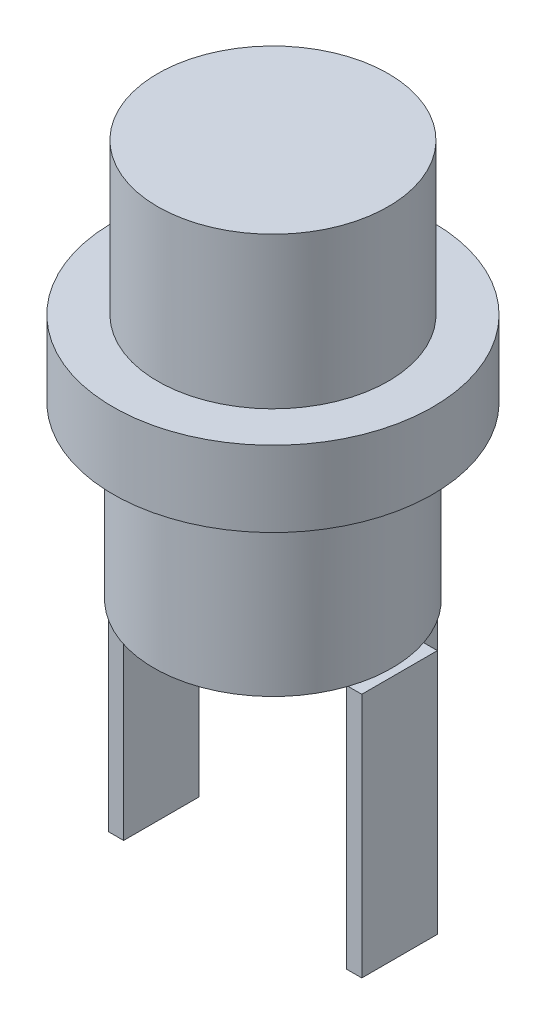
ISO-10303-21;
HEADER;
FILE_DESCRIPTION(('STEP AP214'),'2;1');
FILE_NAME('part.step','',(''),(''),'','','');
FILE_SCHEMA(('AUTOMOTIVE_DESIGN { 1 0 10303 214 1 1 1 1 }'));
ENDSEC;
DATA;
#1=APPLICATION_CONTEXT('core data for automotive mechanical design processes');
#2=APPLICATION_PROTOCOL_DEFINITION('international standard','automotive_design',2000,#1);
#3=PRODUCT_CONTEXT('',#1,'mechanical');
#4=PRODUCT('Part','Part','',(#3));
#5=PRODUCT_RELATED_PRODUCT_CATEGORY('part','',(#4));
#6=PRODUCT_DEFINITION_FORMATION('','',#4);
#7=PRODUCT_DEFINITION_CONTEXT('part definition',#1,'design');
#8=PRODUCT_DEFINITION('design','',#6,#7);
#9=PRODUCT_DEFINITION_SHAPE('','',#8);
#10=(LENGTH_UNIT() NAMED_UNIT(*) SI_UNIT(.MILLI.,.METRE.));
#11=(NAMED_UNIT(*) PLANE_ANGLE_UNIT() SI_UNIT($,.RADIAN.));
#12=(NAMED_UNIT(*) SI_UNIT($,.STERADIAN.) SOLID_ANGLE_UNIT());
#13=UNCERTAINTY_MEASURE_WITH_UNIT(LENGTH_MEASURE(1.E-05),#10,'distance_accuracy_value','');
#14=(GEOMETRIC_REPRESENTATION_CONTEXT(3) GLOBAL_UNCERTAINTY_ASSIGNED_CONTEXT((#13)) GLOBAL_UNIT_ASSIGNED_CONTEXT((#10,
#11,#12)) REPRESENTATION_CONTEXT('',''));
#15=CARTESIAN_POINT('',(0.,0.,0.));
#16=DIRECTION('',(0.,0.,1.));
#17=DIRECTION('',(1.,0.,0.));
#18=AXIS2_PLACEMENT_3D('',#15,#16,#17);
#19=CARTESIAN_POINT('',(0.,-8.2804,0.));
#20=DIRECTION('',(0.,-1.,0.));
#21=DIRECTION('',(0.,0.,-1.));
#22=AXIS2_PLACEMENT_3D('',#19,#20,#21);
#23=PLANE('',#22);
#24=CARTESIAN_POINT('',(0.,-8.2804,0.));
#25=DIRECTION('',(0.,-1.,0.));
#26=DIRECTION('',(0.,0.,-1.));
#27=AXIS2_PLACEMENT_3D('',#24,#25,#26);
#28=CIRCLE('',#27,4.0005);
#29=CARTESIAN_POINT('',(1.27,-8.2804,-3.79356036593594));
#30=VERTEX_POINT('',#29);
#31=CARTESIAN_POINT('',(3.79356036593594,-8.2804,-1.27));
#32=VERTEX_POINT('',#31);
#33=EDGE_CURVE('E284',#30,#32,#28,.T.);
#34=ORIENTED_EDGE('',*,*,#33,.T.);
#35=DIRECTION('',(1.,0.,0.));
#36=VECTOR('',#35,1.);
#37=CARTESIAN_POINT('',(3.7465,-8.2804,-1.27));
#38=LINE('',#37,#36);
#39=CARTESIAN_POINT('',(3.7465,-8.2804,-1.27));
#40=VERTEX_POINT('',#39);
#41=EDGE_CURVE('E50',#40,#32,#38,.T.);
#42=ORIENTED_EDGE('',*,*,#41,.F.);
#43=DIRECTION('',(0.,0.,-1.));
#44=VECTOR('',#43,1.);
#45=CARTESIAN_POINT('',(3.7465,-8.2804,-1.27));
#46=LINE('',#45,#44);
#47=CARTESIAN_POINT('',(3.7465,-8.2804,1.27));
#48=VERTEX_POINT('',#47);
#49=EDGE_CURVE('E55',#48,#40,#46,.T.);
#50=ORIENTED_EDGE('',*,*,#49,.F.);
#51=DIRECTION('',(-1.,0.,0.));
#52=VECTOR('',#51,1.);
#53=CARTESIAN_POINT('',(3.7465,-8.2804,1.27));
#54=LINE('',#53,#52);
#55=CARTESIAN_POINT('',(3.79356036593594,-8.2804,1.27));
#56=VERTEX_POINT('',#55);
#57=EDGE_CURVE('E293',#56,#48,#54,.T.);
#58=ORIENTED_EDGE('',*,*,#57,.F.);
#59=CARTESIAN_POINT('',(-3.79356036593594,-8.2804,1.27));
#60=VERTEX_POINT('',#59);
#61=EDGE_CURVE('E240',#56,#60,#28,.T.);
#62=ORIENTED_EDGE('',*,*,#61,.T.);
#63=DIRECTION('',(-1.,0.,0.));
#64=VECTOR('',#63,1.);
#65=CARTESIAN_POINT('',(-3.7465,-8.2804,1.27));
#66=LINE('',#65,#64);
#67=CARTESIAN_POINT('',(-3.7465,-8.2804,1.27));
#68=VERTEX_POINT('',#67);
#69=EDGE_CURVE('E205',#68,#60,#66,.T.);
#70=ORIENTED_EDGE('',*,*,#69,.F.);
#71=DIRECTION('',(0.,0.,1.));
#72=VECTOR('',#71,1.);
#73=CARTESIAN_POINT('',(-3.7465,-8.2804,-1.27));
#74=LINE('',#73,#72);
#75=CARTESIAN_POINT('',(-3.7465,-8.2804,-1.27));
#76=VERTEX_POINT('',#75);
#77=EDGE_CURVE('E217',#76,#68,#74,.T.);
#78=ORIENTED_EDGE('',*,*,#77,.F.);
#79=DIRECTION('',(1.,0.,0.));
#80=VECTOR('',#79,1.);
#81=CARTESIAN_POINT('',(-3.7465,-8.2804,-1.27));
#82=LINE('',#81,#80);
#83=CARTESIAN_POINT('',(-3.79356036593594,-8.2804,-1.27));
#84=VERTEX_POINT('',#83);
#85=EDGE_CURVE('E43',#84,#76,#82,.T.);
#86=ORIENTED_EDGE('',*,*,#85,.F.);
#87=CARTESIAN_POINT('',(-1.27,-8.2804,-3.79356036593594));
#88=VERTEX_POINT('',#87);
#89=EDGE_CURVE('E239',#84,#88,#28,.T.);
#90=ORIENTED_EDGE('',*,*,#89,.T.);
#91=DIRECTION('',(0.,0.,-1.));
#92=VECTOR('',#91,1.);
#93=CARTESIAN_POINT('',(-1.27,-8.2804,-4.2545));
#94=LINE('',#93,#92);
#95=CARTESIAN_POINT('',(-1.27,-8.2804,-3.7465));
#96=VERTEX_POINT('',#95);
#97=EDGE_CURVE('E166',#96,#88,#94,.T.);
#98=ORIENTED_EDGE('',*,*,#97,.F.);
#99=DIRECTION('',(-1.,0.,0.));
#100=VECTOR('',#99,1.);
#101=CARTESIAN_POINT('',(1.27,-8.2804,-3.7465));
#102=LINE('',#101,#100);
#103=CARTESIAN_POINT('',(1.27,-8.2804,-3.7465));
#104=VERTEX_POINT('',#103);
#105=EDGE_CURVE('E176',#104,#96,#102,.T.);
#106=ORIENTED_EDGE('',*,*,#105,.F.);
#107=DIRECTION('',(0.,0.,-1.));
#108=VECTOR('',#107,1.);
#109=CARTESIAN_POINT('',(1.27,-8.2804,0.));
#110=LINE('',#109,#108);
#111=EDGE_CURVE('E11',#104,#30,#110,.T.);
#112=ORIENTED_EDGE('',*,*,#111,.T.);
#113=EDGE_LOOP('',(#34,#42,#50,#58,#62,#70,#78,#86,#90,#98,#106,#112));
#114=FACE_BOUND('',#113,.T.);
#115=ADVANCED_FACE('F35',(#114),#23,.T.);
#116=CARTESIAN_POINT('',(0.,-2.54,0.));
#117=DIRECTION('',(0.,-1.,0.));
#118=DIRECTION('',(0.,0.,-1.));
#119=AXIS2_PLACEMENT_3D('',#116,#117,#118);
#120=PLANE('',#119);
#121=CARTESIAN_POINT('',(0.,-2.54,0.));
#122=DIRECTION('',(0.,-1.,0.));
#123=DIRECTION('',(0.,0.,-1.));
#124=AXIS2_PLACEMENT_3D('',#121,#122,#123);
#125=CIRCLE('',#124,5.3721);
#126=CARTESIAN_POINT('',(0.,-2.54,-5.3721));
#127=VERTEX_POINT('',#126);
#128=EDGE_CURVE('E243',#127,#127,#125,.T.);
#129=ORIENTED_EDGE('',*,*,#128,.T.);
#130=EDGE_LOOP('',(#129));
#131=FACE_BOUND('',#130,.T.);
#132=CARTESIAN_POINT('',(0.,-2.54,0.));
#133=DIRECTION('',(0.,-1.,0.));
#134=DIRECTION('',(0.,0.,-1.));
#135=AXIS2_PLACEMENT_3D('',#132,#133,#134);
#136=CIRCLE('',#135,4.0005);
#137=CARTESIAN_POINT('',(0.,-2.54,-4.0005));
#138=VERTEX_POINT('',#137);
#139=EDGE_CURVE('E234',#138,#138,#136,.T.);
#140=ORIENTED_EDGE('',*,*,#139,.F.);
#141=EDGE_LOOP('',(#140));
#142=FACE_BOUND('',#141,.T.);
#143=ADVANCED_FACE('F321',(#131,#142),#120,.T.);
#144=CARTESIAN_POINT('',(0.,5.08,0.));
#145=DIRECTION('',(0.,-1.,0.));
#146=DIRECTION('',(0.,0.,-1.));
#147=AXIS2_PLACEMENT_3D('',#144,#145,#146);
#148=CYLINDRICAL_SURFACE('',#147,3.8735);
#149=CARTESIAN_POINT('',(0.,5.08,0.));
#150=DIRECTION('',(0.,1.,0.));
#151=DIRECTION('',(0.,0.,1.));
#152=AXIS2_PLACEMENT_3D('',#149,#150,#151);
#153=CIRCLE('',#152,3.8735);
#154=CARTESIAN_POINT('',(0.,5.08,3.8735));
#155=VERTEX_POINT('',#154);
#156=EDGE_CURVE('E250',#155,#155,#153,.T.);
#157=ORIENTED_EDGE('',*,*,#156,.F.);
#158=EDGE_LOOP('',(#157));
#159=FACE_BOUND('',#158,.T.);
#160=CARTESIAN_POINT('',(0.,0.,0.));
#161=DIRECTION('',(0.,-1.,0.));
#162=DIRECTION('',(0.,0.,-1.));
#163=AXIS2_PLACEMENT_3D('',#160,#161,#162);
#164=CIRCLE('',#163,3.8735);
#165=CARTESIAN_POINT('',(0.,0.,-3.8735));
#166=VERTEX_POINT('',#165);
#167=EDGE_CURVE('E246',#166,#166,#164,.T.);
#168=ORIENTED_EDGE('',*,*,#167,.F.);
#169=EDGE_LOOP('',(#168));
#170=FACE_BOUND('',#169,.T.);
#171=ADVANCED_FACE('F37',(#159,#170),#148,.T.);
#172=CARTESIAN_POINT('',(0.,5.08,0.));
#173=DIRECTION('',(0.,1.,0.));
#174=DIRECTION('',(0.,0.,1.));
#175=AXIS2_PLACEMENT_3D('',#172,#173,#174);
#176=PLANE('',#175);
#177=ORIENTED_EDGE('',*,*,#156,.T.);
#178=EDGE_LOOP('',(#177));
#179=FACE_BOUND('',#178,.T.);
#180=ADVANCED_FACE('F337',(#179),#176,.T.);
#181=CARTESIAN_POINT('',(0.,0.,0.));
#182=DIRECTION('',(0.,-1.,0.));
#183=DIRECTION('',(0.,0.,-1.));
#184=AXIS2_PLACEMENT_3D('',#181,#182,#183);
#185=PLANE('',#184);
#186=CARTESIAN_POINT('',(0.,0.,0.));
#187=DIRECTION('',(0.,-1.,0.));
#188=DIRECTION('',(0.,0.,-1.));
#189=AXIS2_PLACEMENT_3D('',#186,#187,#188);
#190=CIRCLE('',#189,5.3721);
#191=CARTESIAN_POINT('',(0.,0.,-5.3721));
#192=VERTEX_POINT('',#191);
#193=EDGE_CURVE('E238',#192,#192,#190,.T.);
#194=ORIENTED_EDGE('',*,*,#193,.F.);
#195=EDGE_LOOP('',(#194));
#196=FACE_BOUND('',#195,.T.);
#197=ORIENTED_EDGE('',*,*,#167,.T.);
#198=EDGE_LOOP('',(#197));
#199=FACE_BOUND('',#198,.T.);
#200=ADVANCED_FACE('F334',(#196,#199),#185,.F.);
#201=CARTESIAN_POINT('',(0.,-2.54,0.));
#202=DIRECTION('',(0.,1.,0.));
#203=DIRECTION('',(0.,0.,1.));
#204=AXIS2_PLACEMENT_3D('',#201,#202,#203);
#205=CYLINDRICAL_SURFACE('',#204,5.3721);
#206=ORIENTED_EDGE('',*,*,#128,.F.);
#207=EDGE_LOOP('',(#206));
#208=FACE_BOUND('',#207,.T.);
#209=ORIENTED_EDGE('',*,*,#193,.T.);
#210=EDGE_LOOP('',(#209));
#211=FACE_BOUND('',#210,.T.);
#212=ADVANCED_FACE('F332',(#208,#211),#205,.T.);
#213=CARTESIAN_POINT('',(0.,-8.2804,0.));
#214=DIRECTION('',(0.,1.,0.));
#215=DIRECTION('',(0.,0.,1.));
#216=AXIS2_PLACEMENT_3D('',#213,#214,#215);
#217=CYLINDRICAL_SURFACE('',#216,4.0005);
#218=EDGE_CURVE('E235',#60,#84,#28,.T.);
#219=ORIENTED_EDGE('',*,*,#218,.F.);
#220=ORIENTED_EDGE('',*,*,#61,.F.);
#221=EDGE_CURVE('E287',#32,#56,#28,.T.);
#222=ORIENTED_EDGE('',*,*,#221,.F.);
#223=ORIENTED_EDGE('',*,*,#33,.F.);
#224=EDGE_CURVE('E282',#88,#30,#28,.T.);
#225=ORIENTED_EDGE('',*,*,#224,.F.);
#226=ORIENTED_EDGE('',*,*,#89,.F.);
#227=EDGE_LOOP('',(#219,#220,#222,#223,#225,#226));
#228=FACE_BOUND('',#227,.T.);
#229=ORIENTED_EDGE('',*,*,#139,.T.);
#230=EDGE_LOOP('',(#229));
#231=FACE_BOUND('',#230,.T.);
#232=ADVANCED_FACE('F278',(#228,#231),#217,.T.);
#233=CARTESIAN_POINT('',(0.,-8.2804,0.));
#234=DIRECTION('',(0.,-1.,0.));
#235=DIRECTION('',(0.,0.,-1.));
#236=AXIS2_PLACEMENT_3D('',#233,#234,#235);
#237=PLANE('',#236);
#238=CARTESIAN_POINT('',(-4.2545,-8.2804,1.27));
#239=VERTEX_POINT('',#238);
#240=EDGE_CURVE('E220',#60,#239,#66,.T.);
#241=ORIENTED_EDGE('',*,*,#240,.F.);
#242=ORIENTED_EDGE('',*,*,#218,.T.);
#243=CARTESIAN_POINT('',(-4.2545,-8.2804,-1.27));
#244=VERTEX_POINT('',#243);
#245=EDGE_CURVE('E214',#244,#84,#82,.T.);
#246=ORIENTED_EDGE('',*,*,#245,.F.);
#247=DIRECTION('',(0.,0.,-1.));
#248=VECTOR('',#247,1.);
#249=CARTESIAN_POINT('',(-4.2545,-8.2804,-1.27));
#250=LINE('',#249,#248);
#251=EDGE_CURVE('E200',#239,#244,#250,.T.);
#252=ORIENTED_EDGE('',*,*,#251,.F.);
#253=EDGE_LOOP('',(#241,#242,#246,#252));
#254=FACE_BOUND('',#253,.T.);
#255=ADVANCED_FACE('F275',(#254),#237,.F.);
#256=CARTESIAN_POINT('',(-4.2545,-16.5354,-1.27));
#257=DIRECTION('',(1.,0.,0.));
#258=DIRECTION('',(0.,0.,-1.));
#259=AXIS2_PLACEMENT_3D('',#256,#257,#258);
#260=PLANE('',#259);
#261=ORIENTED_EDGE('',*,*,#251,.T.);
#262=DIRECTION('',(0.,1.,0.));
#263=VECTOR('',#262,1.);
#264=CARTESIAN_POINT('',(-4.2545,-16.5354,-1.27));
#265=LINE('',#264,#263);
#266=CARTESIAN_POINT('',(-4.2545,-16.5354,-1.27));
#267=VERTEX_POINT('',#266);
#268=EDGE_CURVE('E231',#267,#244,#265,.T.);
#269=ORIENTED_EDGE('',*,*,#268,.F.);
#270=DIRECTION('',(0.,0.,-1.));
#271=VECTOR('',#270,1.);
#272=CARTESIAN_POINT('',(-4.2545,-16.5354,-1.27));
#273=LINE('',#272,#271);
#274=CARTESIAN_POINT('',(-4.2545,-16.5354,1.27));
#275=VERTEX_POINT('',#274);
#276=EDGE_CURVE('E201',#275,#267,#273,.T.);
#277=ORIENTED_EDGE('',*,*,#276,.F.);
#278=DIRECTION('',(0.,1.,0.));
#279=VECTOR('',#278,1.);
#280=CARTESIAN_POINT('',(-4.2545,-16.5354,1.27));
#281=LINE('',#280,#279);
#282=EDGE_CURVE('E211',#275,#239,#281,.T.);
#283=ORIENTED_EDGE('',*,*,#282,.T.);
#284=EDGE_LOOP('',(#261,#269,#277,#283));
#285=FACE_BOUND('',#284,.T.);
#286=ADVANCED_FACE('F272',(#285),#260,.F.);
#287=CARTESIAN_POINT('',(-3.7465,-16.5354,-1.27));
#288=DIRECTION('',(0.,0.,1.));
#289=DIRECTION('',(1.,0.,0.));
#290=AXIS2_PLACEMENT_3D('',#287,#288,#289);
#291=PLANE('',#290);
#292=ORIENTED_EDGE('',*,*,#245,.T.);
#293=ORIENTED_EDGE('',*,*,#85,.T.);
#294=DIRECTION('',(0.,1.,0.));
#295=VECTOR('',#294,1.);
#296=CARTESIAN_POINT('',(-3.7465,-16.5354,-1.27));
#297=LINE('',#296,#295);
#298=CARTESIAN_POINT('',(-3.7465,-16.5354,-1.27));
#299=VERTEX_POINT('',#298);
#300=EDGE_CURVE('E228',#299,#76,#297,.T.);
#301=ORIENTED_EDGE('',*,*,#300,.F.);
#302=DIRECTION('',(1.,0.,0.));
#303=VECTOR('',#302,1.);
#304=CARTESIAN_POINT('',(-3.7465,-16.5354,-1.27));
#305=LINE('',#304,#303);
#306=EDGE_CURVE('E204',#267,#299,#305,.T.);
#307=ORIENTED_EDGE('',*,*,#306,.F.);
#308=ORIENTED_EDGE('',*,*,#268,.T.);
#309=EDGE_LOOP('',(#292,#293,#301,#307,#308));
#310=FACE_BOUND('',#309,.T.);
#311=ADVANCED_FACE('F257',(#310),#291,.F.);
#312=CARTESIAN_POINT('',(-3.7465,-16.5354,-1.27));
#313=DIRECTION('',(-1.,0.,0.));
#314=DIRECTION('',(0.,0.,1.));
#315=AXIS2_PLACEMENT_3D('',#312,#313,#314);
#316=PLANE('',#315);
#317=ORIENTED_EDGE('',*,*,#77,.T.);
#318=DIRECTION('',(0.,1.,0.));
#319=VECTOR('',#318,1.);
#320=CARTESIAN_POINT('',(-3.7465,-16.5354,1.27));
#321=LINE('',#320,#319);
#322=CARTESIAN_POINT('',(-3.7465,-16.5354,1.27));
#323=VERTEX_POINT('',#322);
#324=EDGE_CURVE('E225',#323,#68,#321,.T.);
#325=ORIENTED_EDGE('',*,*,#324,.F.);
#326=DIRECTION('',(0.,0.,1.));
#327=VECTOR('',#326,1.);
#328=CARTESIAN_POINT('',(-3.7465,-16.5354,-1.27));
#329=LINE('',#328,#327);
#330=EDGE_CURVE('E207',#299,#323,#329,.T.);
#331=ORIENTED_EDGE('',*,*,#330,.F.);
#332=ORIENTED_EDGE('',*,*,#300,.T.);
#333=EDGE_LOOP('',(#317,#325,#331,#332));
#334=FACE_BOUND('',#333,.T.);
#335=ADVANCED_FACE('F262',(#334),#316,.F.);
#336=CARTESIAN_POINT('',(-3.7465,-16.5354,1.27));
#337=DIRECTION('',(0.,0.,-1.));
#338=DIRECTION('',(-1.,0.,0.));
#339=AXIS2_PLACEMENT_3D('',#336,#337,#338);
#340=PLANE('',#339);
#341=ORIENTED_EDGE('',*,*,#69,.T.);
#342=ORIENTED_EDGE('',*,*,#240,.T.);
#343=ORIENTED_EDGE('',*,*,#282,.F.);
#344=DIRECTION('',(-1.,0.,0.));
#345=VECTOR('',#344,1.);
#346=CARTESIAN_POINT('',(-3.7465,-16.5354,1.27));
#347=LINE('',#346,#345);
#348=EDGE_CURVE('E209',#323,#275,#347,.T.);
#349=ORIENTED_EDGE('',*,*,#348,.F.);
#350=ORIENTED_EDGE('',*,*,#324,.T.);
#351=EDGE_LOOP('',(#341,#342,#343,#349,#350));
#352=FACE_BOUND('',#351,.T.);
#353=ADVANCED_FACE('F400',(#352),#340,.F.);
#354=CARTESIAN_POINT('',(0.,-16.5354,0.));
#355=DIRECTION('',(0.,-1.,0.));
#356=DIRECTION('',(0.,0.,-1.));
#357=AXIS2_PLACEMENT_3D('',#354,#355,#356);
#358=PLANE('',#357);
#359=ORIENTED_EDGE('',*,*,#276,.T.);
#360=ORIENTED_EDGE('',*,*,#306,.T.);
#361=ORIENTED_EDGE('',*,*,#330,.T.);
#362=ORIENTED_EDGE('',*,*,#348,.T.);
#363=EDGE_LOOP('',(#359,#360,#361,#362));
#364=FACE_BOUND('',#363,.T.);
#365=ADVANCED_FACE('F266',(#364),#358,.T.);
#366=CARTESIAN_POINT('',(0.,-8.2804,0.));
#367=DIRECTION('',(0.,-1.,0.));
#368=DIRECTION('',(0.,0.,-1.));
#369=AXIS2_PLACEMENT_3D('',#366,#367,#368);
#370=PLANE('',#369);
#371=CARTESIAN_POINT('',(-1.27,-8.2804,-4.2545));
#372=VERTEX_POINT('',#371);
#373=EDGE_CURVE('E164',#88,#372,#94,.T.);
#374=ORIENTED_EDGE('',*,*,#373,.F.);
#375=ORIENTED_EDGE('',*,*,#224,.T.);
#376=DIRECTION('',(0.,0.,1.));
#377=VECTOR('',#376,1.);
#378=CARTESIAN_POINT('',(1.27,-8.2804,-4.2545));
#379=LINE('',#378,#377);
#380=CARTESIAN_POINT('',(1.27,-8.2804,-4.2545));
#381=VERTEX_POINT('',#380);
#382=EDGE_CURVE('E186',#381,#30,#379,.T.);
#383=ORIENTED_EDGE('',*,*,#382,.F.);
#384=DIRECTION('',(1.,0.,0.));
#385=VECTOR('',#384,1.);
#386=CARTESIAN_POINT('',(1.27,-8.2804,-4.2545));
#387=LINE('',#386,#385);
#388=EDGE_CURVE('E184',#372,#381,#387,.T.);
#389=ORIENTED_EDGE('',*,*,#388,.F.);
#390=EDGE_LOOP('',(#374,#375,#383,#389));
#391=FACE_BOUND('',#390,.T.);
#392=ADVANCED_FACE('F418',(#391),#370,.F.);
#393=CARTESIAN_POINT('',(-1.27,-16.5354,-4.2545));
#394=DIRECTION('',(1.,0.,0.));
#395=DIRECTION('',(0.,0.,-1.));
#396=AXIS2_PLACEMENT_3D('',#393,#394,#395);
#397=PLANE('',#396);
#398=ORIENTED_EDGE('',*,*,#97,.T.);
#399=ORIENTED_EDGE('',*,*,#373,.T.);
#400=DIRECTION('',(0.,1.,0.));
#401=VECTOR('',#400,1.);
#402=CARTESIAN_POINT('',(-1.27,-16.5354,-4.2545));
#403=LINE('',#402,#401);
#404=CARTESIAN_POINT('',(-1.27,-16.5354,-4.2545));
#405=VERTEX_POINT('',#404);
#406=EDGE_CURVE('E197',#405,#372,#403,.T.);
#407=ORIENTED_EDGE('',*,*,#406,.F.);
#408=DIRECTION('',(0.,0.,-1.));
#409=VECTOR('',#408,1.);
#410=CARTESIAN_POINT('',(-1.27,-16.5354,-4.2545));
#411=LINE('',#410,#409);
#412=CARTESIAN_POINT('',(-1.27,-16.5354,-3.7465));
#413=VERTEX_POINT('',#412);
#414=EDGE_CURVE('E172',#413,#405,#411,.T.);
#415=ORIENTED_EDGE('',*,*,#414,.F.);
#416=DIRECTION('',(0.,1.,0.));
#417=VECTOR('',#416,1.);
#418=CARTESIAN_POINT('',(-1.27,-16.5354,-3.7465));
#419=LINE('',#418,#417);
#420=EDGE_CURVE('E181',#413,#96,#419,.T.);
#421=ORIENTED_EDGE('',*,*,#420,.T.);
#422=EDGE_LOOP('',(#398,#399,#407,#415,#421));
#423=FACE_BOUND('',#422,.T.);
#424=ADVANCED_FACE('F427',(#423),#397,.F.);
#425=CARTESIAN_POINT('',(1.27,-16.5354,-4.2545));
#426=DIRECTION('',(0.,0.,1.));
#427=DIRECTION('',(1.,0.,0.));
#428=AXIS2_PLACEMENT_3D('',#425,#426,#427);
#429=PLANE('',#428);
#430=ORIENTED_EDGE('',*,*,#388,.T.);
#431=DIRECTION('',(0.,1.,0.));
#432=VECTOR('',#431,1.);
#433=CARTESIAN_POINT('',(1.27,-16.5354,-4.2545));
#434=LINE('',#433,#432);
#435=CARTESIAN_POINT('',(1.27,-16.5354,-4.2545));
#436=VERTEX_POINT('',#435);
#437=EDGE_CURVE('E194',#436,#381,#434,.T.);
#438=ORIENTED_EDGE('',*,*,#437,.F.);
#439=DIRECTION('',(1.,0.,0.));
#440=VECTOR('',#439,1.);
#441=CARTESIAN_POINT('',(1.27,-16.5354,-4.2545));
#442=LINE('',#441,#440);
#443=EDGE_CURVE('E175',#405,#436,#442,.T.);
#444=ORIENTED_EDGE('',*,*,#443,.F.);
#445=ORIENTED_EDGE('',*,*,#406,.T.);
#446=EDGE_LOOP('',(#430,#438,#444,#445));
#447=FACE_BOUND('',#446,.T.);
#448=ADVANCED_FACE('F436',(#447),#429,.F.);
#449=CARTESIAN_POINT('',(1.27,-16.5354,-4.2545));
#450=DIRECTION('',(-1.,0.,0.));
#451=DIRECTION('',(0.,0.,1.));
#452=AXIS2_PLACEMENT_3D('',#449,#450,#451);
#453=PLANE('',#452);
#454=ORIENTED_EDGE('',*,*,#382,.T.);
#455=ORIENTED_EDGE('',*,*,#111,.F.);
#456=DIRECTION('',(0.,1.,0.));
#457=VECTOR('',#456,1.);
#458=CARTESIAN_POINT('',(1.27,-16.5354,-3.7465));
#459=LINE('',#458,#457);
#460=CARTESIAN_POINT('',(1.27,-16.5354,-3.7465));
#461=VERTEX_POINT('',#460);
#462=EDGE_CURVE('E192',#461,#104,#459,.T.);
#463=ORIENTED_EDGE('',*,*,#462,.F.);
#464=DIRECTION('',(0.,0.,1.));
#465=VECTOR('',#464,1.);
#466=CARTESIAN_POINT('',(1.27,-16.5354,-4.2545));
#467=LINE('',#466,#465);
#468=EDGE_CURVE('E178',#436,#461,#467,.T.);
#469=ORIENTED_EDGE('',*,*,#468,.F.);
#470=ORIENTED_EDGE('',*,*,#437,.T.);
#471=EDGE_LOOP('',(#454,#455,#463,#469,#470));
#472=FACE_BOUND('',#471,.T.);
#473=ADVANCED_FACE('F446',(#472),#453,.F.);
#474=CARTESIAN_POINT('',(1.27,-16.5354,-3.7465));
#475=DIRECTION('',(0.,0.,-1.));
#476=DIRECTION('',(-1.,0.,0.));
#477=AXIS2_PLACEMENT_3D('',#474,#475,#476);
#478=PLANE('',#477);
#479=ORIENTED_EDGE('',*,*,#105,.T.);
#480=ORIENTED_EDGE('',*,*,#420,.F.);
#481=DIRECTION('',(-1.,0.,0.));
#482=VECTOR('',#481,1.);
#483=CARTESIAN_POINT('',(1.27,-16.5354,-3.7465));
#484=LINE('',#483,#482);
#485=EDGE_CURVE('E180',#461,#413,#484,.T.);
#486=ORIENTED_EDGE('',*,*,#485,.F.);
#487=ORIENTED_EDGE('',*,*,#462,.T.);
#488=EDGE_LOOP('',(#479,#480,#486,#487));
#489=FACE_BOUND('',#488,.T.);
#490=ADVANCED_FACE('F456',(#489),#478,.F.);
#491=CARTESIAN_POINT('',(0.,-16.5354,0.));
#492=DIRECTION('',(0.,-1.,0.));
#493=DIRECTION('',(0.,0.,-1.));
#494=AXIS2_PLACEMENT_3D('',#491,#492,#493);
#495=PLANE('',#494);
#496=ORIENTED_EDGE('',*,*,#414,.T.);
#497=ORIENTED_EDGE('',*,*,#443,.T.);
#498=ORIENTED_EDGE('',*,*,#468,.T.);
#499=ORIENTED_EDGE('',*,*,#485,.T.);
#500=EDGE_LOOP('',(#496,#497,#498,#499));
#501=FACE_BOUND('',#500,.T.);
#502=ADVANCED_FACE('F466',(#501),#495,.T.);
#503=CARTESIAN_POINT('',(0.,-8.2804,0.));
#504=DIRECTION('',(0.,1.,0.));
#505=DIRECTION('',(0.,0.,1.));
#506=AXIS2_PLACEMENT_3D('',#503,#504,#505);
#507=PLANE('',#506);
#508=ORIENTED_EDGE('',*,*,#221,.T.);
#509=CARTESIAN_POINT('',(4.2545,-8.2804,1.27));
#510=VERTEX_POINT('',#509);
#511=EDGE_CURVE('E161',#510,#56,#54,.T.);
#512=ORIENTED_EDGE('',*,*,#511,.F.);
#513=DIRECTION('',(0.,0.,1.));
#514=VECTOR('',#513,1.);
#515=CARTESIAN_POINT('',(4.2545,-8.2804,-1.27));
#516=LINE('',#515,#514);
#517=CARTESIAN_POINT('',(4.2545,-8.2804,-1.27));
#518=VERTEX_POINT('',#517);
#519=EDGE_CURVE('E295',#518,#510,#516,.T.);
#520=ORIENTED_EDGE('',*,*,#519,.F.);
#521=EDGE_CURVE('E307',#32,#518,#38,.T.);
#522=ORIENTED_EDGE('',*,*,#521,.F.);
#523=EDGE_LOOP('',(#508,#512,#520,#522));
#524=FACE_BOUND('',#523,.T.);
#525=ADVANCED_FACE('F306',(#524),#507,.T.);
#526=CARTESIAN_POINT('',(3.7465,-16.5354,-1.27));
#527=DIRECTION('',(1.,0.,0.));
#528=DIRECTION('',(0.,0.,-1.));
#529=AXIS2_PLACEMENT_3D('',#526,#527,#528);
#530=PLANE('',#529);
#531=ORIENTED_EDGE('',*,*,#49,.T.);
#532=DIRECTION('',(0.,1.,0.));
#533=VECTOR('',#532,1.);
#534=CARTESIAN_POINT('',(3.7465,-16.5354,-1.27));
#535=LINE('',#534,#533);
#536=CARTESIAN_POINT('',(3.7465,-16.5354,-1.27));
#537=VERTEX_POINT('',#536);
#538=EDGE_CURVE('E146',#537,#40,#535,.T.);
#539=ORIENTED_EDGE('',*,*,#538,.F.);
#540=DIRECTION('',(0.,0.,-1.));
#541=VECTOR('',#540,1.);
#542=CARTESIAN_POINT('',(3.7465,-16.5354,-1.27));
#543=LINE('',#542,#541);
#544=CARTESIAN_POINT('',(3.7465,-16.5354,1.27));
#545=VERTEX_POINT('',#544);
#546=EDGE_CURVE('E152',#545,#537,#543,.T.);
#547=ORIENTED_EDGE('',*,*,#546,.F.);
#548=DIRECTION('',(0.,1.,0.));
#549=VECTOR('',#548,1.);
#550=CARTESIAN_POINT('',(3.7465,-16.5354,1.27));
#551=LINE('',#550,#549);
#552=EDGE_CURVE('E300',#545,#48,#551,.T.);
#553=ORIENTED_EDGE('',*,*,#552,.T.);
#554=EDGE_LOOP('',(#531,#539,#547,#553));
#555=FACE_BOUND('',#554,.T.);
#556=ADVANCED_FACE('F163',(#555),#530,.F.);
#557=CARTESIAN_POINT('',(3.7465,-16.5354,-1.27));
#558=DIRECTION('',(0.,0.,1.));
#559=DIRECTION('',(1.,0.,0.));
#560=AXIS2_PLACEMENT_3D('',#557,#558,#559);
#561=PLANE('',#560);
#562=ORIENTED_EDGE('',*,*,#41,.T.);
#563=ORIENTED_EDGE('',*,*,#521,.T.);
#564=DIRECTION('',(0.,1.,0.));
#565=VECTOR('',#564,1.);
#566=CARTESIAN_POINT('',(4.2545,-16.5354,-1.27));
#567=LINE('',#566,#565);
#568=CARTESIAN_POINT('',(4.2545,-16.5354,-1.27));
#569=VERTEX_POINT('',#568);
#570=EDGE_CURVE('E148',#569,#518,#567,.T.);
#571=ORIENTED_EDGE('',*,*,#570,.F.);
#572=DIRECTION('',(1.,0.,0.));
#573=VECTOR('',#572,1.);
#574=CARTESIAN_POINT('',(3.7465,-16.5354,-1.27));
#575=LINE('',#574,#573);
#576=EDGE_CURVE('E142',#537,#569,#575,.T.);
#577=ORIENTED_EDGE('',*,*,#576,.F.);
#578=ORIENTED_EDGE('',*,*,#538,.T.);
#579=EDGE_LOOP('',(#562,#563,#571,#577,#578));
#580=FACE_BOUND('',#579,.T.);
#581=ADVANCED_FACE('F144',(#580),#561,.F.);
#582=CARTESIAN_POINT('',(4.2545,-16.5354,-1.27));
#583=DIRECTION('',(-1.,0.,0.));
#584=DIRECTION('',(0.,0.,1.));
#585=AXIS2_PLACEMENT_3D('',#582,#583,#584);
#586=PLANE('',#585);
#587=ORIENTED_EDGE('',*,*,#519,.T.);
#588=DIRECTION('',(0.,1.,0.));
#589=VECTOR('',#588,1.);
#590=CARTESIAN_POINT('',(4.2545,-16.5354,1.27));
#591=LINE('',#590,#589);
#592=CARTESIAN_POINT('',(4.2545,-16.5354,1.27));
#593=VERTEX_POINT('',#592);
#594=EDGE_CURVE('E168',#593,#510,#591,.T.);
#595=ORIENTED_EDGE('',*,*,#594,.F.);
#596=DIRECTION('',(0.,0.,1.));
#597=VECTOR('',#596,1.);
#598=CARTESIAN_POINT('',(4.2545,-16.5354,-1.27));
#599=LINE('',#598,#597);
#600=EDGE_CURVE('E151',#569,#593,#599,.T.);
#601=ORIENTED_EDGE('',*,*,#600,.F.);
#602=ORIENTED_EDGE('',*,*,#570,.T.);
#603=EDGE_LOOP('',(#587,#595,#601,#602));
#604=FACE_BOUND('',#603,.T.);
#605=ADVANCED_FACE('F308',(#604),#586,.F.);
#606=CARTESIAN_POINT('',(3.7465,-16.5354,1.27));
#607=DIRECTION('',(0.,0.,-1.));
#608=DIRECTION('',(-1.,0.,0.));
#609=AXIS2_PLACEMENT_3D('',#606,#607,#608);
#610=PLANE('',#609);
#611=ORIENTED_EDGE('',*,*,#511,.T.);
#612=ORIENTED_EDGE('',*,*,#57,.T.);
#613=ORIENTED_EDGE('',*,*,#552,.F.);
#614=DIRECTION('',(-1.,0.,0.));
#615=VECTOR('',#614,1.);
#616=CARTESIAN_POINT('',(3.7465,-16.5354,1.27));
#617=LINE('',#616,#615);
#618=EDGE_CURVE('E157',#593,#545,#617,.T.);
#619=ORIENTED_EDGE('',*,*,#618,.F.);
#620=ORIENTED_EDGE('',*,*,#594,.T.);
#621=EDGE_LOOP('',(#611,#612,#613,#619,#620));
#622=FACE_BOUND('',#621,.T.);
#623=ADVANCED_FACE('F303',(#622),#610,.F.);
#624=CARTESIAN_POINT('',(0.,-16.5354,0.));
#625=DIRECTION('',(0.,1.,0.));
#626=DIRECTION('',(0.,0.,1.));
#627=AXIS2_PLACEMENT_3D('',#624,#625,#626);
#628=PLANE('',#627);
#629=ORIENTED_EDGE('',*,*,#546,.T.);
#630=ORIENTED_EDGE('',*,*,#576,.T.);
#631=ORIENTED_EDGE('',*,*,#600,.T.);
#632=ORIENTED_EDGE('',*,*,#618,.T.);
#633=EDGE_LOOP('',(#629,#630,#631,#632));
#634=FACE_BOUND('',#633,.T.);
#635=ADVANCED_FACE('F155',(#634),#628,.F.);
#636=CLOSED_SHELL('',(#115,#143,#171,#180,#200,#212,#232,#255,#286,#311,#335,#353,#365,#392,
#424,#448,#473,#490,#502,#525,#556,#581,#605,#623,#635));
#637=MANIFOLD_SOLID_BREP('B2',#636);
#638=ADVANCED_BREP_SHAPE_REPRESENTATION('',(#18,#637),#14);
#639=SHAPE_DEFINITION_REPRESENTATION(#9,#638);
ENDSEC;
END-ISO-10303-21;
